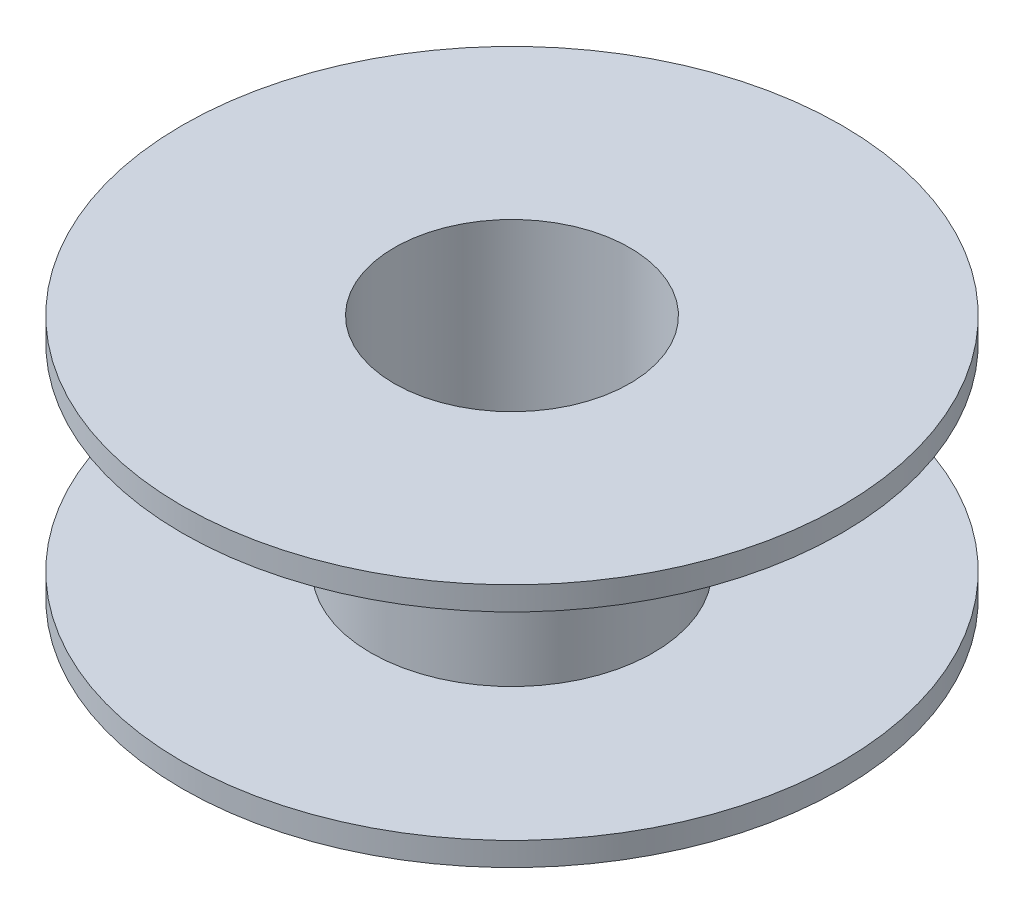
ISO-10303-21;
HEADER;
FILE_DESCRIPTION(('STEP AP214'),'2;1');
FILE_NAME('part.step','',(''),(''),'','','');
FILE_SCHEMA(('AUTOMOTIVE_DESIGN { 1 0 10303 214 1 1 1 1 }'));
ENDSEC;
DATA;
#1=APPLICATION_CONTEXT('core data for automotive mechanical design processes');
#2=APPLICATION_PROTOCOL_DEFINITION('international standard','automotive_design',2000,#1);
#3=PRODUCT_CONTEXT('',#1,'mechanical');
#4=PRODUCT('Part','Part','',(#3));
#5=PRODUCT_RELATED_PRODUCT_CATEGORY('part','',(#4));
#6=PRODUCT_DEFINITION_FORMATION('','',#4);
#7=PRODUCT_DEFINITION_CONTEXT('part definition',#1,'design');
#8=PRODUCT_DEFINITION('design','',#6,#7);
#9=PRODUCT_DEFINITION_SHAPE('','',#8);
#10=(LENGTH_UNIT() NAMED_UNIT(*) SI_UNIT(.MILLI.,.METRE.));
#11=(NAMED_UNIT(*) PLANE_ANGLE_UNIT() SI_UNIT($,.RADIAN.));
#12=(NAMED_UNIT(*) SI_UNIT($,.STERADIAN.) SOLID_ANGLE_UNIT());
#13=UNCERTAINTY_MEASURE_WITH_UNIT(LENGTH_MEASURE(1.E-05),#10,'distance_accuracy_value','');
#14=(GEOMETRIC_REPRESENTATION_CONTEXT(3) GLOBAL_UNCERTAINTY_ASSIGNED_CONTEXT((#13)) GLOBAL_UNIT_ASSIGNED_CONTEXT((#10,
#11,#12)) REPRESENTATION_CONTEXT('',''));
#15=CARTESIAN_POINT('',(0.,0.,0.));
#16=DIRECTION('',(0.,0.,1.));
#17=DIRECTION('',(1.,0.,0.));
#18=AXIS2_PLACEMENT_3D('',#15,#16,#17);
#19=CARTESIAN_POINT('',(0.,3.54545454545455,0.));
#20=DIRECTION('',(0.,1.,0.));
#21=DIRECTION('',(0.,0.,1.));
#22=AXIS2_PLACEMENT_3D('',#19,#20,#21);
#23=CYLINDRICAL_SURFACE('',#22,7.);
#24=CARTESIAN_POINT('',(0.,2.1,0.));
#25=DIRECTION('',(0.,1.,0.));
#26=DIRECTION('',(0.,0.,1.));
#27=AXIS2_PLACEMENT_3D('',#24,#25,#26);
#28=CIRCLE('',#27,7.);
#29=CARTESIAN_POINT('',(0.,2.1,7.));
#30=VERTEX_POINT('',#29);
#31=EDGE_CURVE('E10',#30,#30,#28,.T.);
#32=ORIENTED_EDGE('',*,*,#31,.T.);
#33=EDGE_LOOP('',(#32));
#34=FACE_BOUND('',#33,.T.);
#35=CARTESIAN_POINT('',(0.,2.6,0.));
#36=DIRECTION('',(0.,1.,0.));
#37=DIRECTION('',(0.,0.,1.));
#38=AXIS2_PLACEMENT_3D('',#35,#36,#37);
#39=CIRCLE('',#38,7.);
#40=CARTESIAN_POINT('',(0.,2.6,7.));
#41=VERTEX_POINT('',#40);
#42=EDGE_CURVE('E66',#41,#41,#39,.T.);
#43=ORIENTED_EDGE('',*,*,#42,.F.);
#44=EDGE_LOOP('',(#43));
#45=FACE_BOUND('',#44,.T.);
#46=ADVANCED_FACE('F38',(#34,#45),#23,.T.);
#47=CARTESIAN_POINT('',(-7.,2.1,0.));
#48=DIRECTION('',(0.,-1.,0.));
#49=DIRECTION('',(0.,0.,-1.));
#50=AXIS2_PLACEMENT_3D('',#47,#48,#49);
#51=PLANE('',#50);
#52=CARTESIAN_POINT('',(0.,2.1,0.));
#53=DIRECTION('',(0.,1.,0.));
#54=DIRECTION('',(0.,0.,1.));
#55=AXIS2_PLACEMENT_3D('',#52,#53,#54);
#56=CIRCLE('',#55,3.);
#57=CARTESIAN_POINT('',(0.,2.1,3.));
#58=VERTEX_POINT('',#57);
#59=EDGE_CURVE('E44',#58,#58,#56,.T.);
#60=ORIENTED_EDGE('',*,*,#59,.T.);
#61=EDGE_LOOP('',(#60));
#62=FACE_BOUND('',#61,.T.);
#63=ORIENTED_EDGE('',*,*,#31,.F.);
#64=EDGE_LOOP('',(#63));
#65=FACE_BOUND('',#64,.T.);
#66=ADVANCED_FACE('F74',(#62,#65),#51,.T.);
#67=CARTESIAN_POINT('',(0.,3.54545454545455,0.));
#68=DIRECTION('',(0.,1.,0.));
#69=DIRECTION('',(0.,0.,1.));
#70=AXIS2_PLACEMENT_3D('',#67,#68,#69);
#71=CYLINDRICAL_SURFACE('',#70,3.);
#72=CARTESIAN_POINT('',(0.,-2.1,0.));
#73=DIRECTION('',(0.,1.,0.));
#74=DIRECTION('',(0.,0.,1.));
#75=AXIS2_PLACEMENT_3D('',#72,#73,#74);
#76=CIRCLE('',#75,3.);
#77=CARTESIAN_POINT('',(0.,-2.1,3.));
#78=VERTEX_POINT('',#77);
#79=EDGE_CURVE('E48',#78,#78,#76,.T.);
#80=ORIENTED_EDGE('',*,*,#79,.T.);
#81=EDGE_LOOP('',(#80));
#82=FACE_BOUND('',#81,.T.);
#83=ORIENTED_EDGE('',*,*,#59,.F.);
#84=EDGE_LOOP('',(#83));
#85=FACE_BOUND('',#84,.T.);
#86=ADVANCED_FACE('F78',(#82,#85),#71,.T.);
#87=CARTESIAN_POINT('',(-3.,-2.1,0.));
#88=DIRECTION('',(0.,1.,0.));
#89=DIRECTION('',(0.,0.,1.));
#90=AXIS2_PLACEMENT_3D('',#87,#88,#89);
#91=PLANE('',#90);
#92=CARTESIAN_POINT('',(0.,-2.1,0.));
#93=DIRECTION('',(0.,1.,0.));
#94=DIRECTION('',(0.,0.,1.));
#95=AXIS2_PLACEMENT_3D('',#92,#93,#94);
#96=CIRCLE('',#95,7.);
#97=CARTESIAN_POINT('',(0.,-2.1,7.));
#98=VERTEX_POINT('',#97);
#99=EDGE_CURVE('E52',#98,#98,#96,.T.);
#100=ORIENTED_EDGE('',*,*,#99,.T.);
#101=EDGE_LOOP('',(#100));
#102=FACE_BOUND('',#101,.T.);
#103=ORIENTED_EDGE('',*,*,#79,.F.);
#104=EDGE_LOOP('',(#103));
#105=FACE_BOUND('',#104,.T.);
#106=ADVANCED_FACE('F82',(#102,#105),#91,.T.);
#107=CARTESIAN_POINT('',(0.,3.54545454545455,0.));
#108=DIRECTION('',(0.,1.,0.));
#109=DIRECTION('',(0.,0.,1.));
#110=AXIS2_PLACEMENT_3D('',#107,#108,#109);
#111=CYLINDRICAL_SURFACE('',#110,7.);
#112=CARTESIAN_POINT('',(0.,-2.6,0.));
#113=DIRECTION('',(0.,1.,0.));
#114=DIRECTION('',(0.,0.,1.));
#115=AXIS2_PLACEMENT_3D('',#112,#113,#114);
#116=CIRCLE('',#115,7.);
#117=CARTESIAN_POINT('',(0.,-2.6,7.));
#118=VERTEX_POINT('',#117);
#119=EDGE_CURVE('E57',#118,#118,#116,.T.);
#120=ORIENTED_EDGE('',*,*,#119,.T.);
#121=EDGE_LOOP('',(#120));
#122=FACE_BOUND('',#121,.T.);
#123=ORIENTED_EDGE('',*,*,#99,.F.);
#124=EDGE_LOOP('',(#123));
#125=FACE_BOUND('',#124,.T.);
#126=ADVANCED_FACE('F89',(#122,#125),#111,.T.);
#127=CARTESIAN_POINT('',(-7.,-2.6,0.));
#128=DIRECTION('',(0.,-1.,0.));
#129=DIRECTION('',(0.,0.,-1.));
#130=AXIS2_PLACEMENT_3D('',#127,#128,#129);
#131=PLANE('',#130);
#132=CARTESIAN_POINT('',(0.,-2.6,0.));
#133=DIRECTION('',(0.,1.,0.));
#134=DIRECTION('',(0.,0.,1.));
#135=AXIS2_PLACEMENT_3D('',#132,#133,#134);
#136=CIRCLE('',#135,2.5);
#137=CARTESIAN_POINT('',(0.,-2.6,2.5));
#138=VERTEX_POINT('',#137);
#139=EDGE_CURVE('E60',#138,#138,#136,.T.);
#140=ORIENTED_EDGE('',*,*,#139,.T.);
#141=EDGE_LOOP('',(#140));
#142=FACE_BOUND('',#141,.T.);
#143=ORIENTED_EDGE('',*,*,#119,.F.);
#144=EDGE_LOOP('',(#143));
#145=FACE_BOUND('',#144,.T.);
#146=ADVANCED_FACE('F93',(#142,#145),#131,.T.);
#147=CARTESIAN_POINT('',(0.,3.54545454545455,0.));
#148=DIRECTION('',(0.,1.,0.));
#149=DIRECTION('',(0.,0.,1.));
#150=AXIS2_PLACEMENT_3D('',#147,#148,#149);
#151=CYLINDRICAL_SURFACE('',#150,2.5);
#152=CARTESIAN_POINT('',(0.,2.6,0.));
#153=DIRECTION('',(0.,1.,0.));
#154=DIRECTION('',(0.,0.,1.));
#155=AXIS2_PLACEMENT_3D('',#152,#153,#154);
#156=CIRCLE('',#155,2.5);
#157=CARTESIAN_POINT('',(0.,2.6,2.5));
#158=VERTEX_POINT('',#157);
#159=EDGE_CURVE('E63',#158,#158,#156,.T.);
#160=ORIENTED_EDGE('',*,*,#159,.T.);
#161=EDGE_LOOP('',(#160));
#162=FACE_BOUND('',#161,.T.);
#163=ORIENTED_EDGE('',*,*,#139,.F.);
#164=EDGE_LOOP('',(#163));
#165=FACE_BOUND('',#164,.T.);
#166=ADVANCED_FACE('F97',(#162,#165),#151,.F.);
#167=CARTESIAN_POINT('',(-2.5,2.6,0.));
#168=DIRECTION('',(0.,1.,0.));
#169=DIRECTION('',(0.,0.,1.));
#170=AXIS2_PLACEMENT_3D('',#167,#168,#169);
#171=PLANE('',#170);
#172=ORIENTED_EDGE('',*,*,#42,.T.);
#173=EDGE_LOOP('',(#172));
#174=FACE_BOUND('',#173,.T.);
#175=ORIENTED_EDGE('',*,*,#159,.F.);
#176=EDGE_LOOP('',(#175));
#177=FACE_BOUND('',#176,.T.);
#178=ADVANCED_FACE('F70',(#174,#177),#171,.T.);
#179=CLOSED_SHELL('',(#46,#66,#86,#106,#126,#146,#166,#178));
#180=MANIFOLD_SOLID_BREP('B2',#179);
#181=ADVANCED_BREP_SHAPE_REPRESENTATION('',(#18,#180),#14);
#182=SHAPE_DEFINITION_REPRESENTATION(#9,#181);
ENDSEC;
END-ISO-10303-21;
